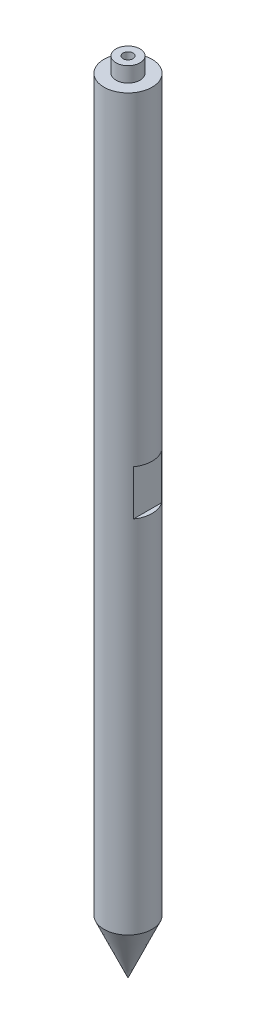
ISO-10303-21;
HEADER;
FILE_DESCRIPTION(('STEP AP214'),'2;1');
FILE_NAME('part.step','',(''),(''),'','','');
FILE_SCHEMA(('AUTOMOTIVE_DESIGN { 1 0 10303 214 1 1 1 1 }'));
ENDSEC;
DATA;
#1=APPLICATION_CONTEXT('core data for automotive mechanical design processes');
#2=APPLICATION_PROTOCOL_DEFINITION('international standard','automotive_design',2000,#1);
#3=PRODUCT_CONTEXT('',#1,'mechanical');
#4=PRODUCT('Part','Part','',(#3));
#5=PRODUCT_RELATED_PRODUCT_CATEGORY('part','',(#4));
#6=PRODUCT_DEFINITION_FORMATION('','',#4);
#7=PRODUCT_DEFINITION_CONTEXT('part definition',#1,'design');
#8=PRODUCT_DEFINITION('design','',#6,#7);
#9=PRODUCT_DEFINITION_SHAPE('','',#8);
#10=(LENGTH_UNIT() NAMED_UNIT(*) SI_UNIT(.MILLI.,.METRE.));
#11=(NAMED_UNIT(*) PLANE_ANGLE_UNIT() SI_UNIT($,.RADIAN.));
#12=(NAMED_UNIT(*) SI_UNIT($,.STERADIAN.) SOLID_ANGLE_UNIT());
#13=UNCERTAINTY_MEASURE_WITH_UNIT(LENGTH_MEASURE(1.E-05),#10,'distance_accuracy_value','');
#14=(GEOMETRIC_REPRESENTATION_CONTEXT(3) GLOBAL_UNCERTAINTY_ASSIGNED_CONTEXT((#13)) GLOBAL_UNIT_ASSIGNED_CONTEXT((#10,
#11,#12)) REPRESENTATION_CONTEXT('',''));
#15=CARTESIAN_POINT('',(0.,0.,0.));
#16=DIRECTION('',(0.,0.,1.));
#17=DIRECTION('',(1.,0.,0.));
#18=AXIS2_PLACEMENT_3D('',#15,#16,#17);
#19=CARTESIAN_POINT('',(0.,0.,0.));
#20=DIRECTION('',(0.,-1.,0.));
#21=DIRECTION('',(0.,0.,-1.));
#22=AXIS2_PLACEMENT_3D('',#19,#20,#21);
#23=PLANE('',#22);
#24=CARTESIAN_POINT('',(0.,0.,0.));
#25=DIRECTION('',(0.,1.,0.));
#26=DIRECTION('',(0.,0.,1.));
#27=AXIS2_PLACEMENT_3D('',#24,#25,#26);
#28=CIRCLE('',#27,4.);
#29=CARTESIAN_POINT('',(0.,0.,4.));
#30=VERTEX_POINT('',#29);
#31=EDGE_CURVE('E109',#30,#30,#28,.T.);
#32=ORIENTED_EDGE('',*,*,#31,.F.);
#33=EDGE_LOOP('',(#32));
#34=FACE_BOUND('',#33,.T.);
#35=CARTESIAN_POINT('',(0.,0.,0.));
#36=DIRECTION('',(0.,-1.,0.));
#37=DIRECTION('',(0.,0.,-1.));
#38=AXIS2_PLACEMENT_3D('',#35,#36,#37);
#39=CIRCLE('',#38,8.);
#40=CARTESIAN_POINT('',(0.,0.,-8.));
#41=VERTEX_POINT('',#40);
#42=EDGE_CURVE('E113',#41,#41,#39,.T.);
#43=ORIENTED_EDGE('',*,*,#42,.F.);
#44=EDGE_LOOP('',(#43));
#45=FACE_BOUND('',#44,.T.);
#46=ADVANCED_FACE('F38',(#34,#45),#23,.F.);
#47=CARTESIAN_POINT('',(0.,-260.,0.));
#48=DIRECTION('',(0.,-1.,0.));
#49=DIRECTION('',(0.,0.,-1.));
#50=AXIS2_PLACEMENT_3D('',#47,#48,#49);
#51=CYLINDRICAL_SURFACE('',#50,7.99999999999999);
#52=DIRECTION('',(0.,-1.,0.));
#53=VECTOR('',#52,1.);
#54=CARTESIAN_POINT('',(6.50000000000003,-260.,4.66368952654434));
#55=LINE('',#54,#53);
#56=CARTESIAN_POINT('',(6.50000000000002,-122.5,4.66368952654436));
#57=VERTEX_POINT('',#56);
#58=CARTESIAN_POINT('',(6.50000000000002,-107.5,4.66368952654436));
#59=VERTEX_POINT('',#58);
#60=EDGE_CURVE('E132',#57,#59,#55,.F.);
#61=ORIENTED_EDGE('',*,*,#60,.T.);
#62=CARTESIAN_POINT('',(0.,-107.5,0.));
#63=DIRECTION('',(0.,1.,0.));
#64=DIRECTION('',(0.,0.,1.));
#65=AXIS2_PLACEMENT_3D('',#62,#63,#64);
#66=CIRCLE('',#65,7.99999999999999);
#67=CARTESIAN_POINT('',(6.50000000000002,-107.5,-4.66368952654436));
#68=VERTEX_POINT('',#67);
#69=EDGE_CURVE('E11',#59,#68,#66,.T.);
#70=ORIENTED_EDGE('',*,*,#69,.T.);
#71=DIRECTION('',(0.,-1.,0.));
#72=VECTOR('',#71,1.);
#73=CARTESIAN_POINT('',(6.50000000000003,-260.,-4.66368952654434));
#74=LINE('',#73,#72);
#75=CARTESIAN_POINT('',(6.50000000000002,-122.5,-4.66368952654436));
#76=VERTEX_POINT('',#75);
#77=EDGE_CURVE('E45',#68,#76,#74,.T.);
#78=ORIENTED_EDGE('',*,*,#77,.T.);
#79=CARTESIAN_POINT('',(0.,-122.5,0.));
#80=DIRECTION('',(0.,-1.,0.));
#81=DIRECTION('',(1.,0.,0.));
#82=AXIS2_PLACEMENT_3D('',#79,#80,#81);
#83=CIRCLE('',#82,7.99999999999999);
#84=EDGE_CURVE('E129',#76,#57,#83,.T.);
#85=ORIENTED_EDGE('',*,*,#84,.T.);
#86=EDGE_LOOP('',(#61,#70,#78,#85));
#87=FACE_BOUND('',#86,.T.);
#88=CARTESIAN_POINT('',(0.,-107.5,0.));
#89=DIRECTION('',(0.,1.,0.));
#90=DIRECTION('',(-1.,0.,0.));
#91=AXIS2_PLACEMENT_3D('',#88,#89,#90);
#92=CIRCLE('',#91,7.99999999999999);
#93=CARTESIAN_POINT('',(-6.49999999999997,-107.5,-4.66368952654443));
#94=VERTEX_POINT('',#93);
#95=CARTESIAN_POINT('',(-6.49999999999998,-107.5,4.66368952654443));
#96=VERTEX_POINT('',#95);
#97=EDGE_CURVE('E120',#94,#96,#92,.T.);
#98=ORIENTED_EDGE('',*,*,#97,.T.);
#99=DIRECTION('',(0.,-1.,0.));
#100=VECTOR('',#99,1.);
#101=CARTESIAN_POINT('',(-6.49999999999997,-260.,4.66368952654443));
#102=LINE('',#101,#100);
#103=CARTESIAN_POINT('',(-6.49999999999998,-122.5,4.66368952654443));
#104=VERTEX_POINT('',#103);
#105=EDGE_CURVE('E126',#96,#104,#102,.T.);
#106=ORIENTED_EDGE('',*,*,#105,.T.);
#107=CARTESIAN_POINT('',(0.,-122.5,0.));
#108=DIRECTION('',(0.,-1.,0.));
#109=DIRECTION('',(0.,0.,-1.));
#110=AXIS2_PLACEMENT_3D('',#107,#108,#109);
#111=CIRCLE('',#110,7.99999999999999);
#112=CARTESIAN_POINT('',(-6.49999999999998,-122.5,-4.66368952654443));
#113=VERTEX_POINT('',#112);
#114=EDGE_CURVE('E123',#104,#113,#111,.T.);
#115=ORIENTED_EDGE('',*,*,#114,.T.);
#116=DIRECTION('',(0.,-1.,0.));
#117=VECTOR('',#116,1.);
#118=CARTESIAN_POINT('',(-6.49999999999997,-260.,-4.66368952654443));
#119=LINE('',#118,#117);
#120=EDGE_CURVE('E112',#113,#94,#119,.F.);
#121=ORIENTED_EDGE('',*,*,#120,.T.);
#122=EDGE_LOOP('',(#98,#106,#115,#121));
#123=FACE_BOUND('',#122,.T.);
#124=CARTESIAN_POINT('',(0.,-242.,0.));
#125=DIRECTION('',(0.,-1.,0.));
#126=DIRECTION('',(0.,0.,-1.));
#127=AXIS2_PLACEMENT_3D('',#124,#125,#126);
#128=CIRCLE('',#127,7.99999999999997);
#129=CARTESIAN_POINT('',(0.,-242.,-7.99999999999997));
#130=VERTEX_POINT('',#129);
#131=EDGE_CURVE('E108',#130,#130,#128,.T.);
#132=ORIENTED_EDGE('',*,*,#131,.F.);
#133=EDGE_LOOP('',(#132));
#134=FACE_BOUND('',#133,.T.);
#135=ORIENTED_EDGE('',*,*,#42,.T.);
#136=EDGE_LOOP('',(#135));
#137=FACE_BOUND('',#136,.T.);
#138=ADVANCED_FACE('F136',(#87,#123,#134,#137),#51,.T.);
#139=CARTESIAN_POINT('',(0.,-242.,0.));
#140=DIRECTION('',(0.,1.,0.));
#141=DIRECTION('',(0.,0.,1.));
#142=AXIS2_PLACEMENT_3D('',#139,#140,#141);
#143=CONICAL_SURFACE('',#142,7.99999999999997,0.418224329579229);
#144=CARTESIAN_POINT('',(0.,-260.,0.));
#145=VERTEX_POINT('',#144);
#146=VERTEX_LOOP('',#145);
#147=FACE_BOUND('',#146,.T.);
#148=ORIENTED_EDGE('',*,*,#131,.T.);
#149=EDGE_LOOP('',(#148));
#150=FACE_BOUND('',#149,.T.);
#151=ADVANCED_FACE('F157',(#147,#150),#143,.T.);
#152=CARTESIAN_POINT('',(0.,5.,0.));
#153=DIRECTION('',(0.,-1.,0.));
#154=DIRECTION('',(0.,0.,-1.));
#155=AXIS2_PLACEMENT_3D('',#152,#153,#154);
#156=CYLINDRICAL_SURFACE('',#155,4.);
#157=CARTESIAN_POINT('',(0.,5.,0.));
#158=DIRECTION('',(0.,1.,0.));
#159=DIRECTION('',(0.,0.,1.));
#160=AXIS2_PLACEMENT_3D('',#157,#158,#159);
#161=CIRCLE('',#160,4.);
#162=CARTESIAN_POINT('',(0.,5.,4.));
#163=VERTEX_POINT('',#162);
#164=EDGE_CURVE('E103',#163,#163,#161,.T.);
#165=ORIENTED_EDGE('',*,*,#164,.F.);
#166=EDGE_LOOP('',(#165));
#167=FACE_BOUND('',#166,.T.);
#168=ORIENTED_EDGE('',*,*,#31,.T.);
#169=EDGE_LOOP('',(#168));
#170=FACE_BOUND('',#169,.T.);
#171=ADVANCED_FACE('F163',(#167,#170),#156,.T.);
#172=CARTESIAN_POINT('',(0.,5.,0.));
#173=DIRECTION('',(0.,1.,0.));
#174=DIRECTION('',(0.,0.,1.));
#175=AXIS2_PLACEMENT_3D('',#172,#173,#174);
#176=PLANE('',#175);
#177=CARTESIAN_POINT('',(0.,5.,0.));
#178=DIRECTION('',(0.,1.,0.));
#179=DIRECTION('',(0.,0.,1.));
#180=AXIS2_PLACEMENT_3D('',#177,#178,#179);
#181=CIRCLE('',#180,1.65);
#182=CARTESIAN_POINT('',(0.,5.,1.65));
#183=VERTEX_POINT('',#182);
#184=EDGE_CURVE('E93',#183,#183,#181,.T.);
#185=ORIENTED_EDGE('',*,*,#184,.F.);
#186=EDGE_LOOP('',(#185));
#187=FACE_BOUND('',#186,.T.);
#188=ORIENTED_EDGE('',*,*,#164,.T.);
#189=EDGE_LOOP('',(#188));
#190=FACE_BOUND('',#189,.T.);
#191=ADVANCED_FACE('F165',(#187,#190),#176,.T.);
#192=CARTESIAN_POINT('',(-6.49999999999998,-122.5,-8.));
#193=DIRECTION('',(0.,-1.,0.));
#194=DIRECTION('',(0.,0.,-1.));
#195=AXIS2_PLACEMENT_3D('',#192,#193,#194);
#196=PLANE('',#195);
#197=DIRECTION('',(0.,0.,1.));
#198=VECTOR('',#197,1.);
#199=CARTESIAN_POINT('',(-6.49999999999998,-122.5,-8.));
#200=LINE('',#199,#198);
#201=EDGE_CURVE('E92',#113,#104,#200,.T.);
#202=ORIENTED_EDGE('',*,*,#201,.F.);
#203=ORIENTED_EDGE('',*,*,#114,.F.);
#204=EDGE_LOOP('',(#202,#203));
#205=FACE_BOUND('',#204,.T.);
#206=ADVANCED_FACE('F172',(#205),#196,.F.);
#207=CARTESIAN_POINT('',(-6.49999999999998,-107.5,-8.));
#208=DIRECTION('',(0.,1.,0.));
#209=DIRECTION('',(-1.,0.,0.));
#210=AXIS2_PLACEMENT_3D('',#207,#208,#209);
#211=PLANE('',#210);
#212=DIRECTION('',(0.,0.,1.));
#213=VECTOR('',#212,1.);
#214=CARTESIAN_POINT('',(-6.49999999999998,-107.5,-8.));
#215=LINE('',#214,#213);
#216=EDGE_CURVE('E59',#94,#96,#215,.T.);
#217=ORIENTED_EDGE('',*,*,#216,.T.);
#218=ORIENTED_EDGE('',*,*,#97,.F.);
#219=EDGE_LOOP('',(#217,#218));
#220=FACE_BOUND('',#219,.T.);
#221=ADVANCED_FACE('F181',(#220),#211,.F.);
#222=CARTESIAN_POINT('',(-6.49999999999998,-107.5,-8.));
#223=DIRECTION('',(1.,0.,0.));
#224=DIRECTION('',(0.,1.,0.));
#225=AXIS2_PLACEMENT_3D('',#222,#223,#224);
#226=PLANE('',#225);
#227=ORIENTED_EDGE('',*,*,#216,.F.);
#228=ORIENTED_EDGE('',*,*,#120,.F.);
#229=ORIENTED_EDGE('',*,*,#201,.T.);
#230=ORIENTED_EDGE('',*,*,#105,.F.);
#231=EDGE_LOOP('',(#227,#228,#229,#230));
#232=FACE_BOUND('',#231,.T.);
#233=ADVANCED_FACE('F150',(#232),#226,.F.);
#234=CARTESIAN_POINT('',(6.50000000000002,-107.5,-8.));
#235=DIRECTION('',(-1.,0.,0.));
#236=DIRECTION('',(0.,-1.,0.));
#237=AXIS2_PLACEMENT_3D('',#234,#235,#236);
#238=PLANE('',#237);
#239=DIRECTION('',(0.,0.,1.));
#240=VECTOR('',#239,1.);
#241=CARTESIAN_POINT('',(6.50000000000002,-107.5,-8.));
#242=LINE('',#241,#240);
#243=EDGE_CURVE('E100',#68,#59,#242,.T.);
#244=ORIENTED_EDGE('',*,*,#243,.T.);
#245=ORIENTED_EDGE('',*,*,#60,.F.);
#246=DIRECTION('',(0.,0.,1.));
#247=VECTOR('',#246,1.);
#248=CARTESIAN_POINT('',(6.50000000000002,-122.5,-8.));
#249=LINE('',#248,#247);
#250=EDGE_CURVE('E51',#76,#57,#249,.T.);
#251=ORIENTED_EDGE('',*,*,#250,.F.);
#252=ORIENTED_EDGE('',*,*,#77,.F.);
#253=EDGE_LOOP('',(#244,#245,#251,#252));
#254=FACE_BOUND('',#253,.T.);
#255=ADVANCED_FACE('F140',(#254),#238,.F.);
#256=CARTESIAN_POINT('',(6.50000000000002,-107.5,-8.));
#257=DIRECTION('',(0.,1.,0.));
#258=DIRECTION('',(0.,0.,1.));
#259=AXIS2_PLACEMENT_3D('',#256,#257,#258);
#260=PLANE('',#259);
#261=ORIENTED_EDGE('',*,*,#243,.F.);
#262=ORIENTED_EDGE('',*,*,#69,.F.);
#263=EDGE_LOOP('',(#261,#262));
#264=FACE_BOUND('',#263,.T.);
#265=ADVANCED_FACE('F142',(#264),#260,.F.);
#266=CARTESIAN_POINT('',(6.50000000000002,-122.5,-8.));
#267=DIRECTION('',(0.,-1.,0.));
#268=DIRECTION('',(1.,0.,0.));
#269=AXIS2_PLACEMENT_3D('',#266,#267,#268);
#270=PLANE('',#269);
#271=ORIENTED_EDGE('',*,*,#250,.T.);
#272=ORIENTED_EDGE('',*,*,#84,.F.);
#273=EDGE_LOOP('',(#271,#272));
#274=FACE_BOUND('',#273,.T.);
#275=ADVANCED_FACE('F86',(#274),#270,.F.);
#276=CARTESIAN_POINT('',(0.,-5.1,0.));
#277=DIRECTION('',(0.,1.,0.));
#278=DIRECTION('',(0.,0.,1.));
#279=AXIS2_PLACEMENT_3D('',#276,#277,#278);
#280=CONICAL_SURFACE('',#279,1.65,1.02974425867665);
#281=CARTESIAN_POINT('',(0.,-6.09142002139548,0.));
#282=VERTEX_POINT('',#281);
#283=VERTEX_LOOP('',#282);
#284=FACE_BOUND('',#283,.T.);
#285=CARTESIAN_POINT('',(0.,-5.1,0.));
#286=DIRECTION('',(0.,1.,0.));
#287=DIRECTION('',(0.,0.,1.));
#288=AXIS2_PLACEMENT_3D('',#285,#286,#287);
#289=CIRCLE('',#288,1.65);
#290=CARTESIAN_POINT('',(0.,-5.1,1.65));
#291=VERTEX_POINT('',#290);
#292=EDGE_CURVE('E90',#291,#291,#289,.T.);
#293=ORIENTED_EDGE('',*,*,#292,.T.);
#294=EDGE_LOOP('',(#293));
#295=FACE_BOUND('',#294,.T.);
#296=ADVANCED_FACE('F82',(#284,#295),#280,.F.);
#297=CARTESIAN_POINT('',(0.,5.,0.));
#298=DIRECTION('',(0.,1.,0.));
#299=DIRECTION('',(0.,0.,1.));
#300=AXIS2_PLACEMENT_3D('',#297,#298,#299);
#301=CYLINDRICAL_SURFACE('',#300,1.65);
#302=ORIENTED_EDGE('',*,*,#292,.F.);
#303=EDGE_LOOP('',(#302));
#304=FACE_BOUND('',#303,.T.);
#305=ORIENTED_EDGE('',*,*,#184,.T.);
#306=EDGE_LOOP('',(#305));
#307=FACE_BOUND('',#306,.T.);
#308=ADVANCED_FACE('F85',(#304,#307),#301,.F.);
#309=CLOSED_SHELL('',(#46,#138,#151,#171,#191,#206,#221,#233,#255,#265,#275,#296,#308));
#310=MANIFOLD_SOLID_BREP('B2',#309);
#311=ADVANCED_BREP_SHAPE_REPRESENTATION('',(#18,#310),#14);
#312=SHAPE_DEFINITION_REPRESENTATION(#9,#311);
ENDSEC;
END-ISO-10303-21;
